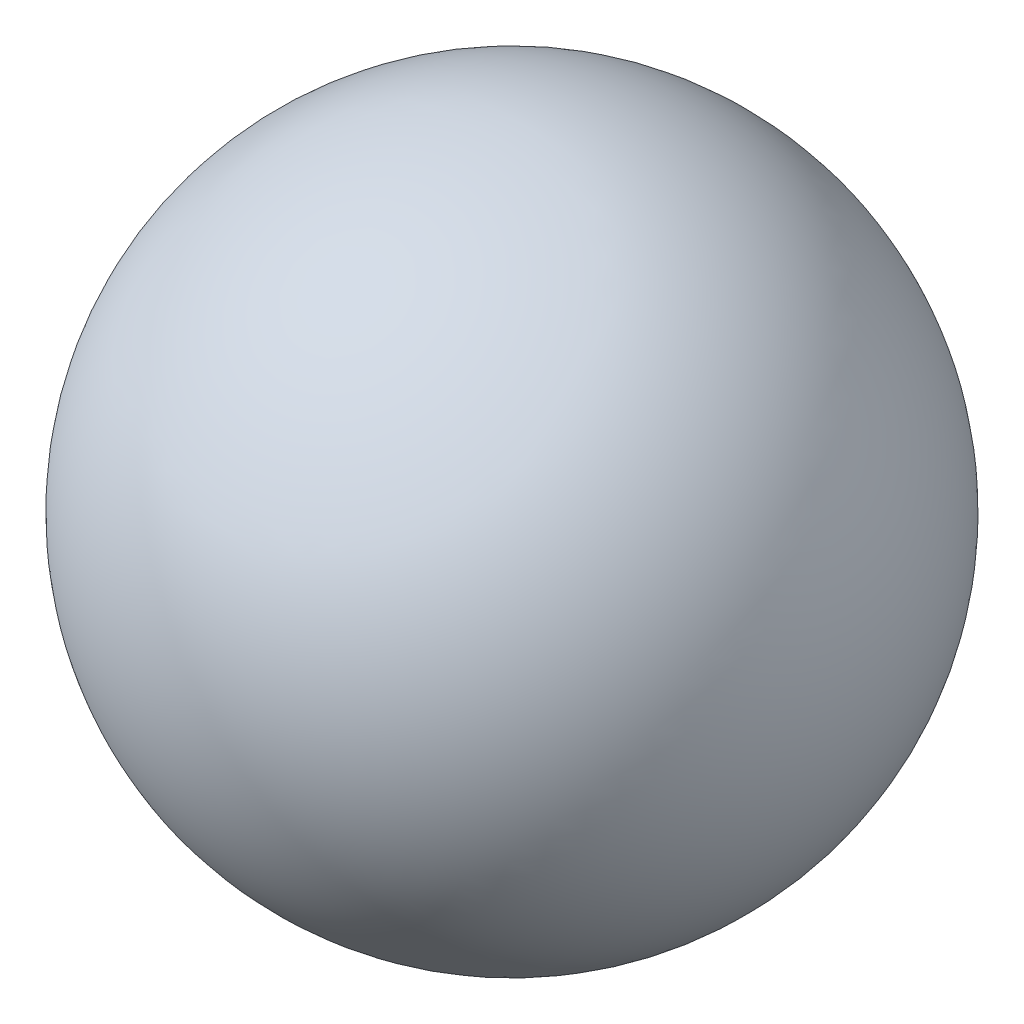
ISO-10303-21;
HEADER;
FILE_DESCRIPTION(('STEP AP214'),'2;1');
FILE_NAME('part.step','',(''),(''),'','','');
FILE_SCHEMA(('AUTOMOTIVE_DESIGN { 1 0 10303 214 1 1 1 1 }'));
ENDSEC;
DATA;
#1=APPLICATION_CONTEXT('core data for automotive mechanical design processes');
#2=APPLICATION_PROTOCOL_DEFINITION('international standard','automotive_design',2000,#1);
#3=PRODUCT_CONTEXT('',#1,'mechanical');
#4=PRODUCT('Part','Part','',(#3));
#5=PRODUCT_RELATED_PRODUCT_CATEGORY('part','',(#4));
#6=PRODUCT_DEFINITION_FORMATION('','',#4);
#7=PRODUCT_DEFINITION_CONTEXT('part definition',#1,'design');
#8=PRODUCT_DEFINITION('design','',#6,#7);
#9=PRODUCT_DEFINITION_SHAPE('','',#8);
#10=(LENGTH_UNIT() NAMED_UNIT(*) SI_UNIT(.MILLI.,.METRE.));
#11=(NAMED_UNIT(*) PLANE_ANGLE_UNIT() SI_UNIT($,.RADIAN.));
#12=(NAMED_UNIT(*) SI_UNIT($,.STERADIAN.) SOLID_ANGLE_UNIT());
#13=UNCERTAINTY_MEASURE_WITH_UNIT(LENGTH_MEASURE(1.E-05),#10,'distance_accuracy_value','');
#14=(GEOMETRIC_REPRESENTATION_CONTEXT(3) GLOBAL_UNCERTAINTY_ASSIGNED_CONTEXT((#13)) GLOBAL_UNIT_ASSIGNED_CONTEXT((#10,
#11,#12)) REPRESENTATION_CONTEXT('',''));
#15=CARTESIAN_POINT('',(0.,0.,0.));
#16=DIRECTION('',(0.,0.,1.));
#17=DIRECTION('',(1.,0.,0.));
#18=AXIS2_PLACEMENT_3D('',#15,#16,#17);
#19=CARTESIAN_POINT('',(0.,0.,-70.));
#20=DIRECTION('',(0.,0.,1.));
#21=DIRECTION('',(0.,1.,0.));
#22=AXIS2_PLACEMENT_3D('',#19,#20,#21);
#23=SPHERICAL_SURFACE('',#22,70.);
#24=CARTESIAN_POINT('',(0.,0.,0.));
#25=VERTEX_POINT('',#24);
#26=VERTEX_LOOP('',#25);
#27=FACE_BOUND('',#26,.T.);
#28=ADVANCED_FACE('F37',(#27),#23,.T.);
#29=CLOSED_SHELL('',(#28));
#30=MANIFOLD_SOLID_BREP('B2',#29);
#31=ADVANCED_BREP_SHAPE_REPRESENTATION('',(#18,#30),#14);
#32=SHAPE_DEFINITION_REPRESENTATION(#9,#31);
ENDSEC;
END-ISO-10303-21;
